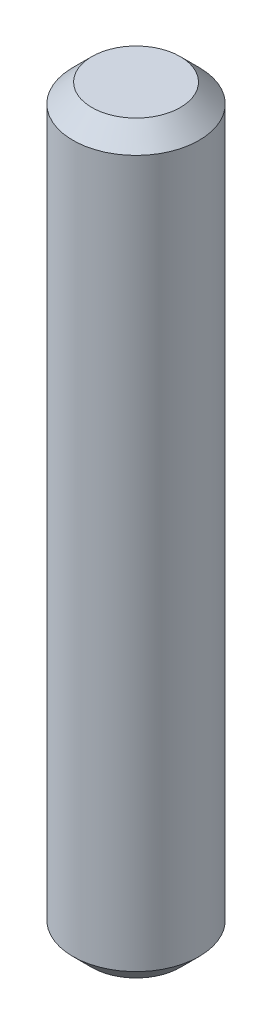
from build123d import *

# Parameters (mm, degrees)
ESQUISSE1_R          = 1
BASE_EXTRUSION_DEPTH = 11.8
CHANFREIN1_SIZE      = 0.3


with BuildPart() as part:
    # Esquisse1 → Base-Extrusion (new body)
    with BuildSketch(Plane(origin=(0, 0, 0), x_dir=(1, 0, 0), z_dir=(0, 1, 0))):
        with Locations(Location((0, 0, 0), (0, 0, 90))):
            Circle(ESQUISSE1_R)
    extrude(amount=BASE_EXTRUSION_DEPTH)

    # Chanfrein1
    chanfrein1_edges = [part.edges().sort_by_distance(p)[0] for p in [
        (0, 0, 1),
        (0, 11.8, 1),
    ]]
    chamfer(chanfrein1_edges, length=CHANFREIN1_SIZE)


solid = part.part
